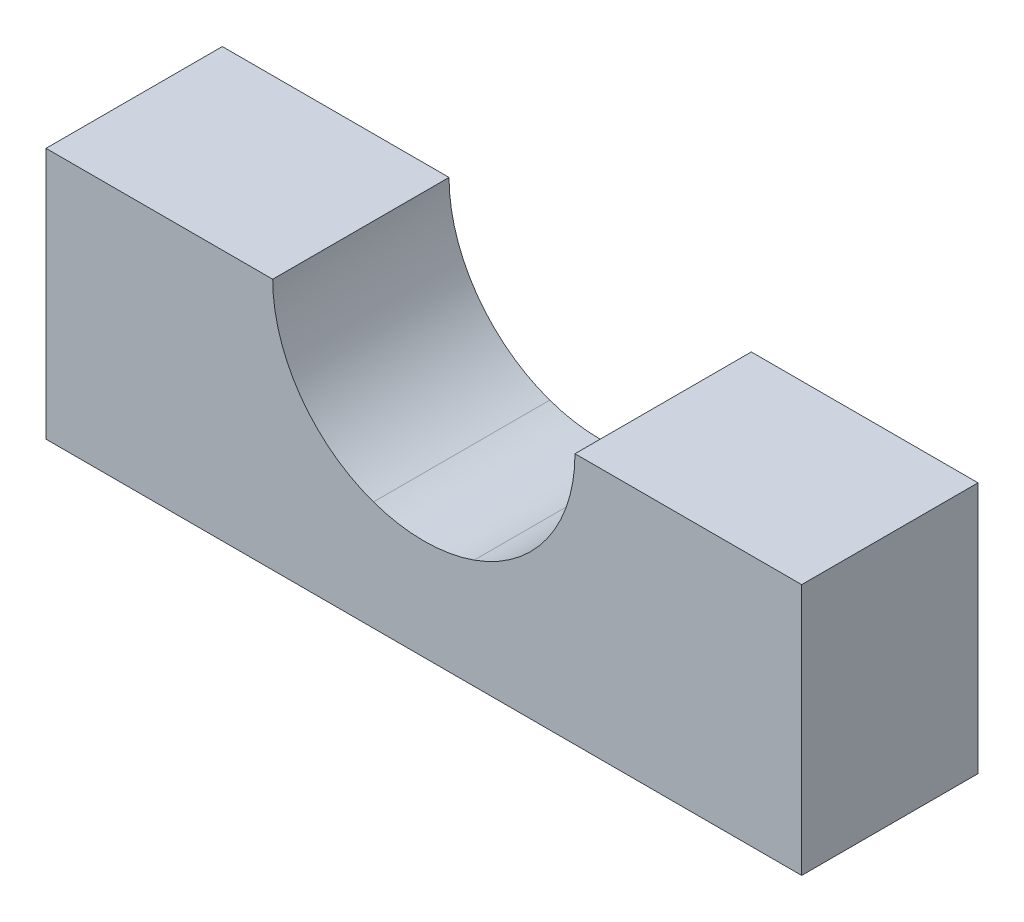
ISO-10303-21;
HEADER;
FILE_DESCRIPTION(('STEP AP214'),'2;1');
FILE_NAME('part.step','',(''),(''),'','','');
FILE_SCHEMA(('AUTOMOTIVE_DESIGN { 1 0 10303 214 1 1 1 1 }'));
ENDSEC;
DATA;
#1=APPLICATION_CONTEXT('core data for automotive mechanical design processes');
#2=APPLICATION_PROTOCOL_DEFINITION('international standard','automotive_design',2000,#1);
#3=PRODUCT_CONTEXT('',#1,'mechanical');
#4=PRODUCT('Part','Part','',(#3));
#5=PRODUCT_RELATED_PRODUCT_CATEGORY('part','',(#4));
#6=PRODUCT_DEFINITION_FORMATION('','',#4);
#7=PRODUCT_DEFINITION_CONTEXT('part definition',#1,'design');
#8=PRODUCT_DEFINITION('design','',#6,#7);
#9=PRODUCT_DEFINITION_SHAPE('','',#8);
#10=(LENGTH_UNIT() NAMED_UNIT(*) SI_UNIT(.MILLI.,.METRE.));
#11=(NAMED_UNIT(*) PLANE_ANGLE_UNIT() SI_UNIT($,.RADIAN.));
#12=(NAMED_UNIT(*) SI_UNIT($,.STERADIAN.) SOLID_ANGLE_UNIT());
#13=UNCERTAINTY_MEASURE_WITH_UNIT(LENGTH_MEASURE(1.E-05),#10,'distance_accuracy_value','');
#14=(GEOMETRIC_REPRESENTATION_CONTEXT(3) GLOBAL_UNCERTAINTY_ASSIGNED_CONTEXT((#13)) GLOBAL_UNIT_ASSIGNED_CONTEXT((#10,
#11,#12)) REPRESENTATION_CONTEXT('',''));
#15=CARTESIAN_POINT('',(0.,0.,0.));
#16=DIRECTION('',(0.,0.,1.));
#17=DIRECTION('',(1.,0.,0.));
#18=AXIS2_PLACEMENT_3D('',#15,#16,#17);
#19=CARTESIAN_POINT('',(150.,100.,0.));
#20=DIRECTION('',(0.,0.,1.));
#21=DIRECTION('',(1.,0.,0.));
#22=AXIS2_PLACEMENT_3D('',#19,#20,#21);
#23=CYLINDRICAL_SURFACE('',#22,60.);
#24=DIRECTION('',(0.,0.,1.));
#25=VECTOR('',#24,1.);
#26=CARTESIAN_POINT('',(130.,43.4314575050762,0.));
#27=LINE('',#26,#25);
#28=CARTESIAN_POINT('',(130.,43.4314575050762,0.));
#29=VERTEX_POINT('',#28);
#30=CARTESIAN_POINT('',(130.,43.4314575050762,70.));
#31=VERTEX_POINT('',#30);
#32=EDGE_CURVE('E11',#29,#31,#27,.T.);
#33=ORIENTED_EDGE('',*,*,#32,.F.);
#34=CARTESIAN_POINT('',(150.,100.,0.));
#35=DIRECTION('',(0.,0.,1.));
#36=DIRECTION('',(1.,0.,0.));
#37=AXIS2_PLACEMENT_3D('',#34,#35,#36);
#38=CIRCLE('',#37,60.);
#39=CARTESIAN_POINT('',(90.,100.,0.));
#40=VERTEX_POINT('',#39);
#41=EDGE_CURVE('E114',#40,#29,#38,.T.);
#42=ORIENTED_EDGE('',*,*,#41,.F.);
#43=DIRECTION('',(0.,0.,1.));
#44=VECTOR('',#43,1.);
#45=CARTESIAN_POINT('',(90.,100.,0.));
#46=LINE('',#45,#44);
#47=CARTESIAN_POINT('',(90.,100.,70.));
#48=VERTEX_POINT('',#47);
#49=EDGE_CURVE('E113',#40,#48,#46,.T.);
#50=ORIENTED_EDGE('',*,*,#49,.T.);
#51=CARTESIAN_POINT('',(150.,100.,70.));
#52=DIRECTION('',(0.,0.,1.));
#53=DIRECTION('',(1.,0.,0.));
#54=AXIS2_PLACEMENT_3D('',#51,#52,#53);
#55=CIRCLE('',#54,60.);
#56=EDGE_CURVE('E105',#48,#31,#55,.T.);
#57=ORIENTED_EDGE('',*,*,#56,.T.);
#58=EDGE_LOOP('',(#33,#42,#50,#57));
#59=FACE_BOUND('',#58,.T.);
#60=ADVANCED_FACE('F32',(#59),#23,.F.);
#61=DIRECTION('',(0.,0.,1.));
#62=VECTOR('',#61,1.);
#63=CARTESIAN_POINT('',(170.,43.4314575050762,0.));
#64=LINE('',#63,#62);
#65=CARTESIAN_POINT('',(170.,43.4314575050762,70.));
#66=VERTEX_POINT('',#65);
#67=CARTESIAN_POINT('',(170.,43.4314575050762,0.));
#68=VERTEX_POINT('',#67);
#69=EDGE_CURVE('E41',#66,#68,#64,.F.);
#70=ORIENTED_EDGE('',*,*,#69,.F.);
#71=CARTESIAN_POINT('',(210.,100.,70.));
#72=VERTEX_POINT('',#71);
#73=EDGE_CURVE('E95',#66,#72,#55,.T.);
#74=ORIENTED_EDGE('',*,*,#73,.T.);
#75=DIRECTION('',(0.,0.,1.));
#76=VECTOR('',#75,1.);
#77=CARTESIAN_POINT('',(210.,100.,0.));
#78=LINE('',#77,#76);
#79=CARTESIAN_POINT('',(210.,100.,0.));
#80=VERTEX_POINT('',#79);
#81=EDGE_CURVE('E98',#80,#72,#78,.T.);
#82=ORIENTED_EDGE('',*,*,#81,.F.);
#83=EDGE_CURVE('E170',#68,#80,#38,.T.);
#84=ORIENTED_EDGE('',*,*,#83,.F.);
#85=EDGE_LOOP('',(#70,#74,#82,#84));
#86=FACE_BOUND('',#85,.T.);
#87=ADVANCED_FACE('F97',(#86),#23,.F.);
#88=CARTESIAN_POINT('',(0.,100.,70.));
#89=DIRECTION('',(0.,-1.,0.));
#90=DIRECTION('',(0.,0.,-1.));
#91=AXIS2_PLACEMENT_3D('',#88,#89,#90);
#92=PLANE('',#91);
#93=DIRECTION('',(-1.,0.,0.));
#94=VECTOR('',#93,1.);
#95=CARTESIAN_POINT('',(0.,100.,0.));
#96=LINE('',#95,#94);
#97=CARTESIAN_POINT('',(300.,100.,0.));
#98=VERTEX_POINT('',#97);
#99=EDGE_CURVE('E112',#98,#80,#96,.T.);
#100=ORIENTED_EDGE('',*,*,#99,.T.);
#101=ORIENTED_EDGE('',*,*,#81,.T.);
#102=DIRECTION('',(-1.,0.,0.));
#103=VECTOR('',#102,1.);
#104=CARTESIAN_POINT('',(0.,100.,70.));
#105=LINE('',#104,#103);
#106=CARTESIAN_POINT('',(300.,100.,70.));
#107=VERTEX_POINT('',#106);
#108=EDGE_CURVE('E110',#107,#72,#105,.T.);
#109=ORIENTED_EDGE('',*,*,#108,.F.);
#110=DIRECTION('',(0.,0.,-1.));
#111=VECTOR('',#110,1.);
#112=CARTESIAN_POINT('',(300.,100.,70.));
#113=LINE('',#112,#111);
#114=EDGE_CURVE('E124',#107,#98,#113,.T.);
#115=ORIENTED_EDGE('',*,*,#114,.T.);
#116=EDGE_LOOP('',(#100,#101,#109,#115));
#117=FACE_BOUND('',#116,.T.);
#118=ADVANCED_FACE('F108',(#117),#92,.F.);
#119=CARTESIAN_POINT('',(0.,0.,70.));
#120=DIRECTION('',(1.,0.,0.));
#121=DIRECTION('',(0.,0.,-1.));
#122=AXIS2_PLACEMENT_3D('',#119,#120,#121);
#123=PLANE('',#122);
#124=DIRECTION('',(0.,-1.,0.));
#125=VECTOR('',#124,1.);
#126=CARTESIAN_POINT('',(0.,0.,0.));
#127=LINE('',#126,#125);
#128=CARTESIAN_POINT('',(0.,100.,0.));
#129=VERTEX_POINT('',#128);
#130=CARTESIAN_POINT('',(0.,0.,0.));
#131=VERTEX_POINT('',#130);
#132=EDGE_CURVE('E151',#129,#131,#127,.T.);
#133=ORIENTED_EDGE('',*,*,#132,.T.);
#134=DIRECTION('',(0.,0.,-1.));
#135=VECTOR('',#134,1.);
#136=CARTESIAN_POINT('',(0.,0.,70.));
#137=LINE('',#136,#135);
#138=CARTESIAN_POINT('',(0.,0.,70.));
#139=VERTEX_POINT('',#138);
#140=EDGE_CURVE('E133',#139,#131,#137,.T.);
#141=ORIENTED_EDGE('',*,*,#140,.F.);
#142=DIRECTION('',(0.,-1.,0.));
#143=VECTOR('',#142,1.);
#144=CARTESIAN_POINT('',(0.,0.,70.));
#145=LINE('',#144,#143);
#146=CARTESIAN_POINT('',(0.,100.,70.));
#147=VERTEX_POINT('',#146);
#148=EDGE_CURVE('E163',#147,#139,#145,.T.);
#149=ORIENTED_EDGE('',*,*,#148,.F.);
#150=DIRECTION('',(0.,0.,-1.));
#151=VECTOR('',#150,1.);
#152=CARTESIAN_POINT('',(0.,100.,70.));
#153=LINE('',#152,#151);
#154=EDGE_CURVE('E120',#147,#129,#153,.T.);
#155=ORIENTED_EDGE('',*,*,#154,.T.);
#156=EDGE_LOOP('',(#133,#141,#149,#155));
#157=FACE_BOUND('',#156,.T.);
#158=ADVANCED_FACE('F34',(#157),#123,.F.);
#159=CARTESIAN_POINT('',(0.,0.,70.));
#160=DIRECTION('',(0.,1.,0.));
#161=DIRECTION('',(0.,0.,1.));
#162=AXIS2_PLACEMENT_3D('',#159,#160,#161);
#163=PLANE('',#162);
#164=DIRECTION('',(1.,0.,0.));
#165=VECTOR('',#164,1.);
#166=CARTESIAN_POINT('',(0.,0.,0.));
#167=LINE('',#166,#165);
#168=CARTESIAN_POINT('',(300.,0.,0.));
#169=VERTEX_POINT('',#168);
#170=EDGE_CURVE('E145',#131,#169,#167,.T.);
#171=ORIENTED_EDGE('',*,*,#170,.T.);
#172=DIRECTION('',(0.,0.,-1.));
#173=VECTOR('',#172,1.);
#174=CARTESIAN_POINT('',(300.,0.,70.));
#175=LINE('',#174,#173);
#176=CARTESIAN_POINT('',(300.,0.,70.));
#177=VERTEX_POINT('',#176);
#178=EDGE_CURVE('E130',#177,#169,#175,.T.);
#179=ORIENTED_EDGE('',*,*,#178,.F.);
#180=DIRECTION('',(1.,0.,0.));
#181=VECTOR('',#180,1.);
#182=CARTESIAN_POINT('',(0.,0.,70.));
#183=LINE('',#182,#181);
#184=EDGE_CURVE('E146',#139,#177,#183,.T.);
#185=ORIENTED_EDGE('',*,*,#184,.F.);
#186=ORIENTED_EDGE('',*,*,#140,.T.);
#187=EDGE_LOOP('',(#171,#179,#185,#186));
#188=FACE_BOUND('',#187,.T.);
#189=ADVANCED_FACE('F143',(#188),#163,.F.);
#190=CARTESIAN_POINT('',(300.,0.,70.));
#191=DIRECTION('',(-1.,0.,0.));
#192=DIRECTION('',(0.,-1.,0.));
#193=AXIS2_PLACEMENT_3D('',#190,#191,#192);
#194=PLANE('',#193);
#195=DIRECTION('',(0.,1.,0.));
#196=VECTOR('',#195,1.);
#197=CARTESIAN_POINT('',(300.,0.,0.));
#198=LINE('',#197,#196);
#199=EDGE_CURVE('E156',#169,#98,#198,.T.);
#200=ORIENTED_EDGE('',*,*,#199,.T.);
#201=ORIENTED_EDGE('',*,*,#114,.F.);
#202=DIRECTION('',(0.,1.,0.));
#203=VECTOR('',#202,1.);
#204=CARTESIAN_POINT('',(300.,0.,70.));
#205=LINE('',#204,#203);
#206=EDGE_CURVE('E118',#177,#107,#205,.T.);
#207=ORIENTED_EDGE('',*,*,#206,.F.);
#208=ORIENTED_EDGE('',*,*,#178,.T.);
#209=EDGE_LOOP('',(#200,#201,#207,#208));
#210=FACE_BOUND('',#209,.T.);
#211=ADVANCED_FACE('F166',(#210),#194,.F.);
#212=EDGE_CURVE('E121',#48,#147,#105,.T.);
#213=ORIENTED_EDGE('',*,*,#212,.F.);
#214=ORIENTED_EDGE('',*,*,#49,.F.);
#215=EDGE_CURVE('E161',#40,#129,#96,.T.);
#216=ORIENTED_EDGE('',*,*,#215,.T.);
#217=ORIENTED_EDGE('',*,*,#154,.F.);
#218=EDGE_LOOP('',(#213,#214,#216,#217));
#219=FACE_BOUND('',#218,.T.);
#220=ADVANCED_FACE('F177',(#219),#92,.F.);
#221=CARTESIAN_POINT('',(0.,100.,70.));
#222=DIRECTION('',(0.,0.,-1.));
#223=DIRECTION('',(-1.,0.,0.));
#224=AXIS2_PLACEMENT_3D('',#221,#222,#223);
#225=PLANE('',#224);
#226=ORIENTED_EDGE('',*,*,#108,.T.);
#227=ORIENTED_EDGE('',*,*,#73,.F.);
#228=EDGE_CURVE('E103',#31,#66,#55,.T.);
#229=ORIENTED_EDGE('',*,*,#228,.F.);
#230=ORIENTED_EDGE('',*,*,#56,.F.);
#231=ORIENTED_EDGE('',*,*,#212,.T.);
#232=ORIENTED_EDGE('',*,*,#148,.T.);
#233=ORIENTED_EDGE('',*,*,#184,.T.);
#234=ORIENTED_EDGE('',*,*,#206,.T.);
#235=EDGE_LOOP('',(#226,#227,#229,#230,#231,#232,#233,#234));
#236=FACE_BOUND('',#235,.T.);
#237=ADVANCED_FACE('F116',(#236),#225,.F.);
#238=CARTESIAN_POINT('',(0.,100.,0.));
#239=DIRECTION('',(0.,0.,-1.));
#240=DIRECTION('',(-1.,0.,0.));
#241=AXIS2_PLACEMENT_3D('',#238,#239,#240);
#242=PLANE('',#241);
#243=ORIENTED_EDGE('',*,*,#41,.T.);
#244=EDGE_CURVE('E171',#29,#68,#38,.T.);
#245=ORIENTED_EDGE('',*,*,#244,.T.);
#246=ORIENTED_EDGE('',*,*,#83,.T.);
#247=ORIENTED_EDGE('',*,*,#99,.F.);
#248=ORIENTED_EDGE('',*,*,#199,.F.);
#249=ORIENTED_EDGE('',*,*,#170,.F.);
#250=ORIENTED_EDGE('',*,*,#132,.F.);
#251=ORIENTED_EDGE('',*,*,#215,.F.);
#252=EDGE_LOOP('',(#243,#245,#246,#247,#248,#249,#250,#251));
#253=FACE_BOUND('',#252,.T.);
#254=ADVANCED_FACE('F168',(#253),#242,.T.);
#255=ORIENTED_EDGE('',*,*,#244,.F.);
#256=ORIENTED_EDGE('',*,*,#32,.T.);
#257=ORIENTED_EDGE('',*,*,#228,.T.);
#258=ORIENTED_EDGE('',*,*,#69,.T.);
#259=EDGE_LOOP('',(#255,#256,#257,#258));
#260=FACE_BOUND('',#259,.T.);
#261=ADVANCED_FACE('F178',(#260),#23,.F.);
#262=CLOSED_SHELL('',(#60,#87,#118,#158,#189,#211,#220,#237,#254,#261));
#263=MANIFOLD_SOLID_BREP('B2',#262);
#264=ADVANCED_BREP_SHAPE_REPRESENTATION('',(#18,#263),#14);
#265=SHAPE_DEFINITION_REPRESENTATION(#9,#264);
ENDSEC;
END-ISO-10303-21;
